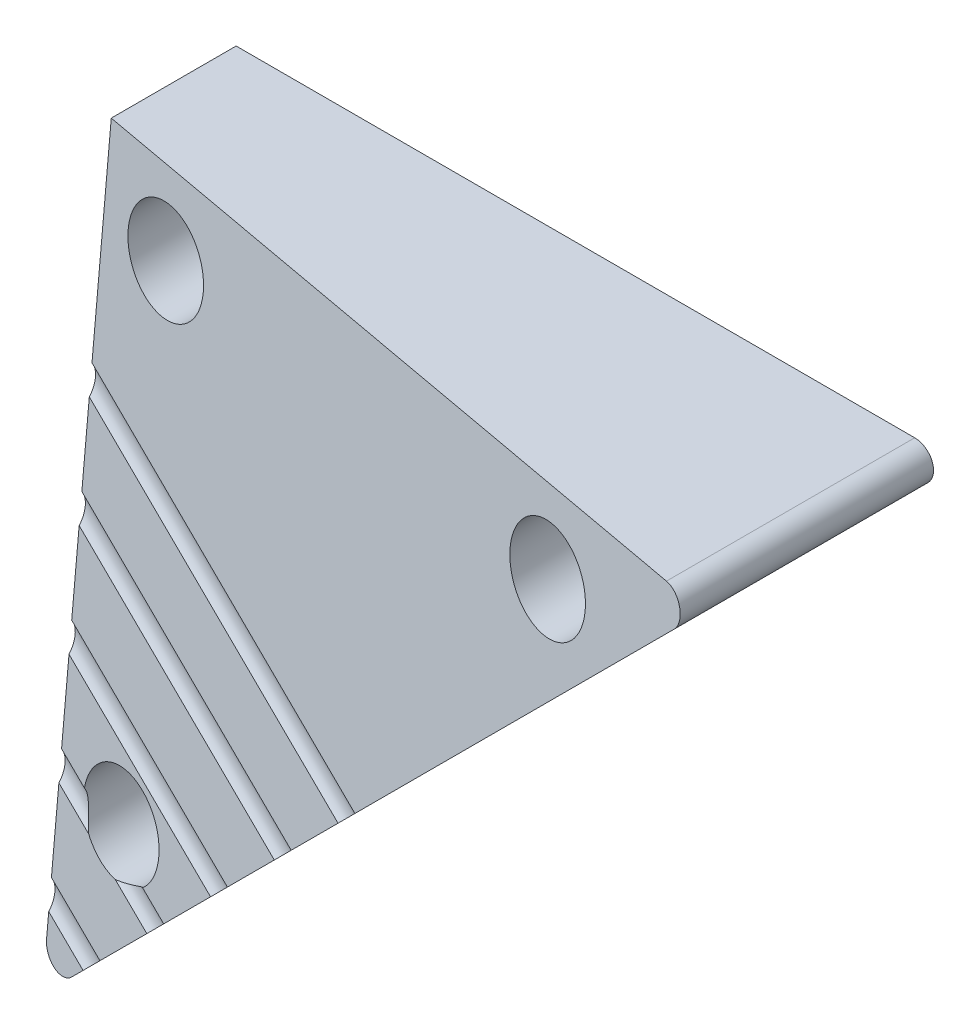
from build123d import *

# Parameters (mm, degrees)
BOSS_EXTRUDE1_DEPTH = 44.45
FILLET1_R           = 3.175
HOLE1_D             = 10.3124
HOLE1_CBORE_D       = 15.4686
HOLE1_CBORE_DEPTH   = 36.576
SKETCH2_R           = 3.175
CUT_EXTRUDE1_DEPTH  = 590.358112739


with BuildPart() as part:
    # Sketch1 → Boss-Extrude1 (new body)
    with BuildSketch(Plane.XY):
        Polygon((-1196.34, 149.225), (-1196.34, 27.196051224), (-1074.311051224, 149.225), align=None)
    extrude(amount=BOSS_EXTRUDE1_DEPTH)

    # Fillet1
    fillet1_edges = [part.edges().sort_by_distance(p)[0] for p in [
        (-1196.34, 27.196051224, 22.225),
        (-1074.311051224, 149.225, 22.225),
    ]]
    fillet(fillet1_edges, radius=FILLET1_R)

    # Hole1 (through all)
    with Locations(Plane(origin=(-1196.509107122, 137.459999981, 44.45), x_dir=(1, 0, 0), z_dir=(0, 0, 1))):
        with Locations((12.869107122, -0.934999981), (12.869107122, -79.603436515), (91.537543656, -0.934999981)):
            CounterBoreHole(HOLE1_D / 2, HOLE1_CBORE_D / 2, HOLE1_CBORE_DEPTH)

    # SurfaceCut1
    split(bisect_by=Plane(origin=(-36.34804059, 19.06055787, 244.364223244), x_dir=(-0.9840117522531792, -0.016904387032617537, -0.17729950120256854), z_dir=(0.17810354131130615, -0.09339575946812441, -0.9795694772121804)), keep=Keep.TOP)

    # Sketch2 → Cut-Extrude1 (cut, through all)
    with BuildSketch(Plane(origin=(-861.900524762, 451.972226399, -199.801881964), x_dir=(-0.17810354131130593, 0.09339575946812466, 0.9795694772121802), z_dir=(-0.8675263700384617, 0.45492236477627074, -0.20110603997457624))):
        with Locations((250.00687444, -503.356978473)):
            Circle(SKETCH2_R)
        with Locations((250.00687444, -487.481978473)):
            Circle(SKETCH2_R)
        with Locations((250.00687444, -471.606978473)):
            Circle(SKETCH2_R)
        with Locations((250.00687444, -455.731978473)):
            Circle(SKETCH2_R)
        with Locations((250.00687444, -519.231978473)):
            Circle(SKETCH2_R)
    extrude(amount=CUT_EXTRUDE1_DEPTH, mode=Mode.SUBTRACT)


solid = part.part
